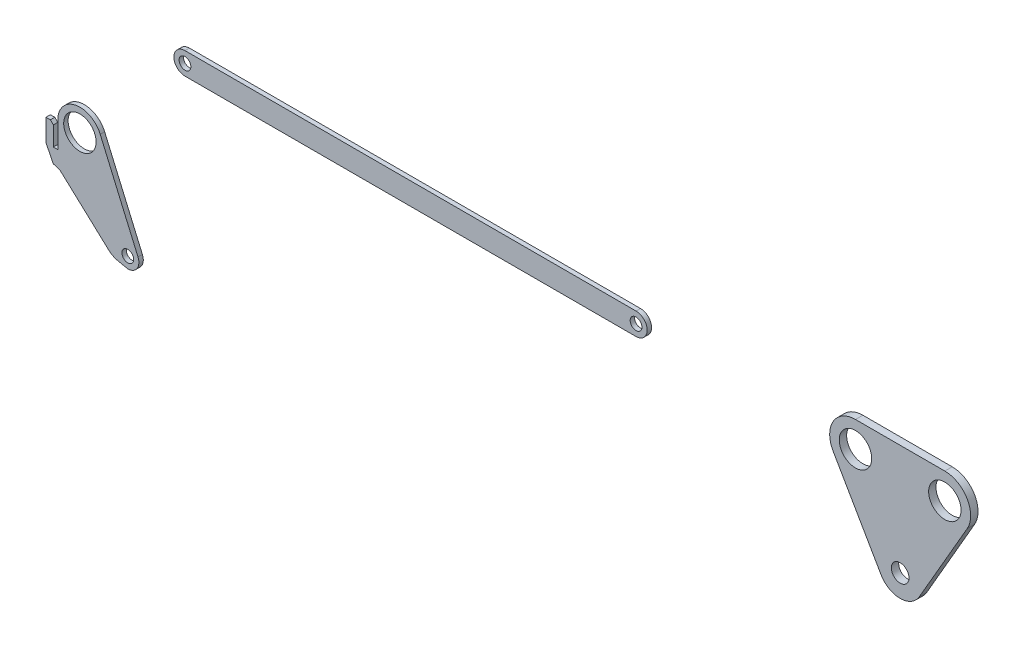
from build123d import *

# Parameters (mm, degrees)
SKETCH1_R           = 11
SKETCH1_R_2         = 6
BOSS_EXTRUDE1_DEPTH = 5
SKETCH2_R           = 4
BOSS_EXTRUDE2_DEPTH = 3
SKETCH3_R           = 11
SKETCH3_R_2         = 4
BOSS_EXTRUDE3_DEPTH = 3


with BuildPart() as part:
    # Sketch1 → Boss-Extrude1 (new body)
    with BuildSketch(Plane.XY):
        with BuildLine():
            Line((12.990381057, -47.5), (45.466333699, 8.75))
            ThreePointArc((45.466333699, 8.75), (45.466333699, 26.25), (30.310889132, 35))
            Line((30.310889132, 35), (-30.310889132, 35))
            ThreePointArc((-30.310889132, 35), (-45.466333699, 26.25), (-45.466333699, 8.75))
            Line((-45.466333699, 8.75), (-12.990381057, -47.5))
            ThreePointArc((-12.990381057, -47.5), (0, -55), (12.990381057, -47.5))
        make_face()
        with Locations((-30.310889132, 17.5)):
            Circle(SKETCH1_R, mode=Mode.SUBTRACT)
        with Locations((30.310889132, 17.5)):
            Circle(SKETCH1_R, mode=Mode.SUBTRACT)
        with Locations((0, -40)):
            Circle(SKETCH1_R_2, mode=Mode.SUBTRACT)
    extrude(amount=BOSS_EXTRUDE1_DEPTH)


with BuildPart() as body_2:
    # Sketch2 → Boss-Extrude2 (new body)
    with BuildSketch(Plane.XY.offset(25)):
        with BuildLine():
            Line((-462.140133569, 47.274090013), (-156.140133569, 47.274090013))
            ThreePointArc((-156.140133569, 47.274090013), (-148.640133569, 39.774090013), (-156.140133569, 32.274090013))
            Line((-156.140133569, 32.274090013), (-462.140133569, 32.274090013))
            ThreePointArc((-462.140133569, 32.274090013), (-469.640133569, 39.774090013), (-462.140133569, 47.274090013))
        make_face()
        with Locations((-156.140133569, 39.774090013)):
            Circle(SKETCH2_R, mode=Mode.SUBTRACT)
        with Locations((-462.140133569, 39.774090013)):
            Circle(SKETCH2_R, mode=Mode.SUBTRACT)
    extrude(amount=BOSS_EXTRUDE2_DEPTH)


with BuildPart() as body_3:
    # Sketch3 → Boss-Extrude3 (new body)
    with BuildSketch(Plane.XY.offset(50)):
        with BuildLine():
            Line((-494.643805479, -5.618946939), (-469.028306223, -64.886106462))
            ThreePointArc((-469.028306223, -64.886106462), (-469.645179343, -71.980697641), (-475.912806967, -75.361614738))
            Line((-475.912806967, -75.361614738), (-484.261867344, -73.603917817))
            Line((-484.261867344, -73.603917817), (-487.691647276, -71.838673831))
            Line((-487.691647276, -71.838673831), (-521.940126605, -40.368280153))
            Line((-521.940126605, -40.368280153), (-525.412806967, -39.01505713))
            Line((-525.412806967, -39.01505713), (-526.412806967, -39.01505713))
            Line((-526.412806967, -39.01505713), (-531.412806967, -29.01505713))
            Line((-531.412806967, -29.01505713), (-531.412806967, -14.01505713))
            Line((-531.412806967, -14.01505713), (-528.412806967, -14.01505713))
            Line((-528.412806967, -14.01505713), (-526.412806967, -16.01505713))
            Line((-526.412806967, -16.01505713), (-526.412806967, -29.01505713))
            Line((-526.412806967, -29.01505713), (-523.412806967, -29.01505713))
            Line((-523.412806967, -29.01505713), (-523.412806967, -11.569963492))
            ThreePointArc((-523.412806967, -11.569963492), (-511.451308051, 3.119063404), (-494.643805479, -5.618946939))
        make_face()
        with Locations((-508.412806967, -11.569963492)):
            Circle(SKETCH3_R, mode=Mode.SUBTRACT)
        with Locations((-475.912806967, -67.861614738)):
            Circle(SKETCH3_R_2, mode=Mode.SUBTRACT)
    extrude(amount=BOSS_EXTRUDE3_DEPTH)


solid = Compound([part.part, body_2.part, body_3.part])
